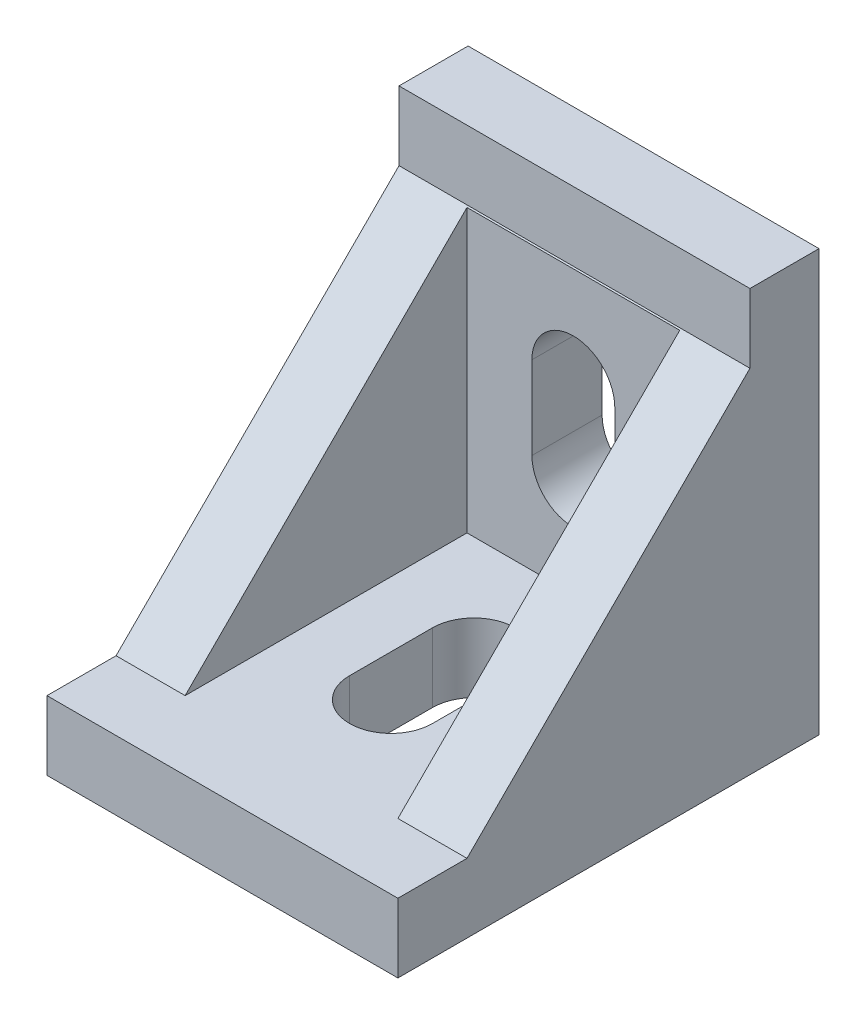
ISO-10303-21;
HEADER;
FILE_DESCRIPTION(('STEP AP214'),'2;1');
FILE_NAME('part.step','',(''),(''),'','','');
FILE_SCHEMA(('AUTOMOTIVE_DESIGN { 1 0 10303 214 1 1 1 1 }'));
ENDSEC;
DATA;
#1=APPLICATION_CONTEXT('core data for automotive mechanical design processes');
#2=APPLICATION_PROTOCOL_DEFINITION('international standard','automotive_design',2000,#1);
#3=PRODUCT_CONTEXT('',#1,'mechanical');
#4=PRODUCT('Part','Part','',(#3));
#5=PRODUCT_RELATED_PRODUCT_CATEGORY('part','',(#4));
#6=PRODUCT_DEFINITION_FORMATION('','',#4);
#7=PRODUCT_DEFINITION_CONTEXT('part definition',#1,'design');
#8=PRODUCT_DEFINITION('design','',#6,#7);
#9=PRODUCT_DEFINITION_SHAPE('','',#8);
#10=(LENGTH_UNIT() NAMED_UNIT(*) SI_UNIT(.MILLI.,.METRE.));
#11=(NAMED_UNIT(*) PLANE_ANGLE_UNIT() SI_UNIT($,.RADIAN.));
#12=(NAMED_UNIT(*) SI_UNIT($,.STERADIAN.) SOLID_ANGLE_UNIT());
#13=UNCERTAINTY_MEASURE_WITH_UNIT(LENGTH_MEASURE(1.E-05),#10,'distance_accuracy_value','');
#14=(GEOMETRIC_REPRESENTATION_CONTEXT(3) GLOBAL_UNCERTAINTY_ASSIGNED_CONTEXT((#13)) GLOBAL_UNIT_ASSIGNED_CONTEXT((#10,
#11,#12)) REPRESENTATION_CONTEXT('',''));
#15=CARTESIAN_POINT('',(0.,0.,0.));
#16=DIRECTION('',(0.,0.,1.));
#17=DIRECTION('',(1.,0.,0.));
#18=AXIS2_PLACEMENT_3D('',#15,#16,#17);
#19=CARTESIAN_POINT('',(25.4,5.,0.));
#20=DIRECTION('',(0.,0.,-1.));
#21=DIRECTION('',(0.,1.,0.));
#22=AXIS2_PLACEMENT_3D('',#19,#20,#21);
#23=PLANE('',#22);
#24=DIRECTION('',(0.,-1.,0.));
#25=VECTOR('',#24,1.);
#26=CARTESIAN_POINT('',(0.,5.,0.));
#27=LINE('',#26,#25);
#28=CARTESIAN_POINT('',(0.,5.,0.));
#29=VERTEX_POINT('',#28);
#30=CARTESIAN_POINT('',(0.,0.,0.));
#31=VERTEX_POINT('',#30);
#32=EDGE_CURVE('E261',#29,#31,#27,.T.);
#33=ORIENTED_EDGE('',*,*,#32,.T.);
#34=DIRECTION('',(-1.,0.,0.));
#35=VECTOR('',#34,1.);
#36=CARTESIAN_POINT('',(25.4,0.,0.));
#37=LINE('',#36,#35);
#38=CARTESIAN_POINT('',(25.4,0.,0.));
#39=VERTEX_POINT('',#38);
#40=EDGE_CURVE('E331',#39,#31,#37,.T.);
#41=ORIENTED_EDGE('',*,*,#40,.F.);
#42=DIRECTION('',(0.,-1.,0.));
#43=VECTOR('',#42,1.);
#44=CARTESIAN_POINT('',(25.4,5.,0.));
#45=LINE('',#44,#43);
#46=CARTESIAN_POINT('',(25.4,5.,0.));
#47=VERTEX_POINT('',#46);
#48=EDGE_CURVE('E262',#47,#39,#45,.T.);
#49=ORIENTED_EDGE('',*,*,#48,.F.);
#50=DIRECTION('',(-1.,0.,0.));
#51=VECTOR('',#50,1.);
#52=CARTESIAN_POINT('',(25.4,5.,0.));
#53=LINE('',#52,#51);
#54=EDGE_CURVE('E285',#47,#29,#53,.T.);
#55=ORIENTED_EDGE('',*,*,#54,.T.);
#56=EDGE_LOOP('',(#33,#41,#49,#55));
#57=FACE_BOUND('',#56,.T.);
#58=ADVANCED_FACE('F45',(#57),#23,.F.);
#59=CARTESIAN_POINT('',(25.4,0.,0.));
#60=DIRECTION('',(0.,1.,0.));
#61=DIRECTION('',(0.,0.,1.));
#62=AXIS2_PLACEMENT_3D('',#59,#60,#61);
#63=PLANE('',#62);
#64=DIRECTION('',(0.,0.,-1.));
#65=VECTOR('',#64,1.);
#66=CARTESIAN_POINT('',(15.7,0.,-18.2));
#67=LINE('',#66,#65);
#68=CARTESIAN_POINT('',(15.7,0.,-12.2));
#69=VERTEX_POINT('',#68);
#70=CARTESIAN_POINT('',(15.7,0.,-18.2));
#71=VERTEX_POINT('',#70);
#72=EDGE_CURVE('E178',#69,#71,#67,.T.);
#73=ORIENTED_EDGE('',*,*,#72,.T.);
#74=CARTESIAN_POINT('',(12.7,0.,-18.2));
#75=DIRECTION('',(0.,1.,0.));
#76=DIRECTION('',(0.,0.,1.));
#77=AXIS2_PLACEMENT_3D('',#74,#75,#76);
#78=CIRCLE('',#77,2.99999999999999);
#79=CARTESIAN_POINT('',(9.70000000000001,0.,-18.2));
#80=VERTEX_POINT('',#79);
#81=EDGE_CURVE('E173',#71,#80,#78,.T.);
#82=ORIENTED_EDGE('',*,*,#81,.T.);
#83=DIRECTION('',(0.,0.,1.));
#84=VECTOR('',#83,1.);
#85=CARTESIAN_POINT('',(9.70000000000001,0.,-18.2));
#86=LINE('',#85,#84);
#87=CARTESIAN_POINT('',(9.70000000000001,0.,-12.2));
#88=VERTEX_POINT('',#87);
#89=EDGE_CURVE('E181',#80,#88,#86,.T.);
#90=ORIENTED_EDGE('',*,*,#89,.T.);
#91=CARTESIAN_POINT('',(12.7,0.,-12.2));
#92=DIRECTION('',(0.,1.,0.));
#93=DIRECTION('',(0.,0.,1.));
#94=AXIS2_PLACEMENT_3D('',#91,#92,#93);
#95=CIRCLE('',#94,2.99999999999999);
#96=EDGE_CURVE('E60',#88,#69,#95,.T.);
#97=ORIENTED_EDGE('',*,*,#96,.T.);
#98=EDGE_LOOP('',(#73,#82,#90,#97));
#99=FACE_BOUND('',#98,.T.);
#100=DIRECTION('',(0.,0.,-1.));
#101=VECTOR('',#100,1.);
#102=CARTESIAN_POINT('',(0.,0.,0.));
#103=LINE('',#102,#101);
#104=CARTESIAN_POINT('',(0.,0.,-30.48));
#105=VERTEX_POINT('',#104);
#106=EDGE_CURVE('E289',#31,#105,#103,.T.);
#107=ORIENTED_EDGE('',*,*,#106,.T.);
#108=DIRECTION('',(-1.,0.,0.));
#109=VECTOR('',#108,1.);
#110=CARTESIAN_POINT('',(25.4,0.,-30.48));
#111=LINE('',#110,#109);
#112=CARTESIAN_POINT('',(25.4,0.,-30.48));
#113=VERTEX_POINT('',#112);
#114=EDGE_CURVE('E327',#113,#105,#111,.T.);
#115=ORIENTED_EDGE('',*,*,#114,.F.);
#116=DIRECTION('',(0.,0.,-1.));
#117=VECTOR('',#116,1.);
#118=CARTESIAN_POINT('',(25.4,0.,0.));
#119=LINE('',#118,#117);
#120=EDGE_CURVE('E266',#39,#113,#119,.T.);
#121=ORIENTED_EDGE('',*,*,#120,.F.);
#122=ORIENTED_EDGE('',*,*,#40,.T.);
#123=EDGE_LOOP('',(#107,#115,#121,#122));
#124=FACE_BOUND('',#123,.T.);
#125=ADVANCED_FACE('F186',(#99,#124),#63,.F.);
#126=CARTESIAN_POINT('',(25.4,0.,-30.48));
#127=DIRECTION('',(0.,0.,1.));
#128=DIRECTION('',(1.,0.,0.));
#129=AXIS2_PLACEMENT_3D('',#126,#127,#128);
#130=PLANE('',#129);
#131=DIRECTION('',(0.,1.,0.));
#132=VECTOR('',#131,1.);
#133=CARTESIAN_POINT('',(15.7,18.2,-30.48));
#134=LINE('',#133,#132);
#135=CARTESIAN_POINT('',(15.7,12.2,-30.48));
#136=VERTEX_POINT('',#135);
#137=CARTESIAN_POINT('',(15.7,18.2,-30.48));
#138=VERTEX_POINT('',#137);
#139=EDGE_CURVE('E217',#136,#138,#134,.T.);
#140=ORIENTED_EDGE('',*,*,#139,.T.);
#141=CARTESIAN_POINT('',(12.7,18.2,-30.48));
#142=DIRECTION('',(0.,0.,1.));
#143=DIRECTION('',(1.,0.,0.));
#144=AXIS2_PLACEMENT_3D('',#141,#142,#143);
#145=CIRCLE('',#144,3.);
#146=CARTESIAN_POINT('',(9.7,18.2,-30.48));
#147=VERTEX_POINT('',#146);
#148=EDGE_CURVE('E199',#138,#147,#145,.T.);
#149=ORIENTED_EDGE('',*,*,#148,.T.);
#150=DIRECTION('',(0.,-1.,0.));
#151=VECTOR('',#150,1.);
#152=CARTESIAN_POINT('',(9.7,18.2,-30.48));
#153=LINE('',#152,#151);
#154=CARTESIAN_POINT('',(9.7,12.2,-30.48));
#155=VERTEX_POINT('',#154);
#156=EDGE_CURVE('E209',#147,#155,#153,.T.);
#157=ORIENTED_EDGE('',*,*,#156,.T.);
#158=CARTESIAN_POINT('',(12.7,12.2,-30.48));
#159=DIRECTION('',(0.,0.,1.));
#160=DIRECTION('',(1.,0.,0.));
#161=AXIS2_PLACEMENT_3D('',#158,#159,#160);
#162=CIRCLE('',#161,3.);
#163=EDGE_CURVE('E213',#155,#136,#162,.T.);
#164=ORIENTED_EDGE('',*,*,#163,.T.);
#165=EDGE_LOOP('',(#140,#149,#157,#164));
#166=FACE_BOUND('',#165,.T.);
#167=DIRECTION('',(0.,1.,0.));
#168=VECTOR('',#167,1.);
#169=CARTESIAN_POINT('',(0.,0.,-30.48));
#170=LINE('',#169,#168);
#171=CARTESIAN_POINT('',(0.,30.48,-30.48));
#172=VERTEX_POINT('',#171);
#173=EDGE_CURVE('E292',#105,#172,#170,.T.);
#174=ORIENTED_EDGE('',*,*,#173,.T.);
#175=DIRECTION('',(-1.,0.,0.));
#176=VECTOR('',#175,1.);
#177=CARTESIAN_POINT('',(25.4,30.48,-30.48));
#178=LINE('',#177,#176);
#179=CARTESIAN_POINT('',(25.4,30.48,-30.48));
#180=VERTEX_POINT('',#179);
#181=EDGE_CURVE('E323',#180,#172,#178,.T.);
#182=ORIENTED_EDGE('',*,*,#181,.F.);
#183=DIRECTION('',(0.,1.,0.));
#184=VECTOR('',#183,1.);
#185=CARTESIAN_POINT('',(25.4,0.,-30.48));
#186=LINE('',#185,#184);
#187=EDGE_CURVE('E270',#113,#180,#186,.T.);
#188=ORIENTED_EDGE('',*,*,#187,.F.);
#189=ORIENTED_EDGE('',*,*,#114,.T.);
#190=EDGE_LOOP('',(#174,#182,#188,#189));
#191=FACE_BOUND('',#190,.T.);
#192=ADVANCED_FACE('F380',(#166,#191),#130,.F.);
#193=CARTESIAN_POINT('',(25.4,30.48,-30.48));
#194=DIRECTION('',(0.,-1.,0.));
#195=DIRECTION('',(0.,0.,-1.));
#196=AXIS2_PLACEMENT_3D('',#193,#194,#195);
#197=PLANE('',#196);
#198=DIRECTION('',(0.,0.,1.));
#199=VECTOR('',#198,1.);
#200=CARTESIAN_POINT('',(0.,30.48,-30.48));
#201=LINE('',#200,#199);
#202=CARTESIAN_POINT('',(0.,30.48,-25.48));
#203=VERTEX_POINT('',#202);
#204=EDGE_CURVE('E295',#172,#203,#201,.T.);
#205=ORIENTED_EDGE('',*,*,#204,.T.);
#206=DIRECTION('',(-1.,0.,0.));
#207=VECTOR('',#206,1.);
#208=CARTESIAN_POINT('',(25.4,30.48,-25.48));
#209=LINE('',#208,#207);
#210=CARTESIAN_POINT('',(25.4,30.48,-25.48));
#211=VERTEX_POINT('',#210);
#212=EDGE_CURVE('E319',#211,#203,#209,.T.);
#213=ORIENTED_EDGE('',*,*,#212,.F.);
#214=DIRECTION('',(0.,0.,1.));
#215=VECTOR('',#214,1.);
#216=CARTESIAN_POINT('',(25.4,30.48,-30.48));
#217=LINE('',#216,#215);
#218=EDGE_CURVE('E273',#180,#211,#217,.T.);
#219=ORIENTED_EDGE('',*,*,#218,.F.);
#220=ORIENTED_EDGE('',*,*,#181,.T.);
#221=EDGE_LOOP('',(#205,#213,#219,#220));
#222=FACE_BOUND('',#221,.T.);
#223=ADVANCED_FACE('F412',(#222),#197,.F.);
#224=CARTESIAN_POINT('',(25.4,30.48,-25.48));
#225=DIRECTION('',(0.,0.,-1.));
#226=DIRECTION('',(-1.,0.,0.));
#227=AXIS2_PLACEMENT_3D('',#224,#225,#226);
#228=PLANE('',#227);
#229=DIRECTION('',(0.,-1.,0.));
#230=VECTOR('',#229,1.);
#231=CARTESIAN_POINT('',(0.,30.48,-25.48));
#232=LINE('',#231,#230);
#233=CARTESIAN_POINT('',(0.,25.48,-25.48));
#234=VERTEX_POINT('',#233);
#235=EDGE_CURVE('E298',#203,#234,#232,.T.);
#236=ORIENTED_EDGE('',*,*,#235,.T.);
#237=DIRECTION('',(-1.,0.,0.));
#238=VECTOR('',#237,1.);
#239=CARTESIAN_POINT('',(25.4,25.48,-25.48));
#240=LINE('',#239,#238);
#241=CARTESIAN_POINT('',(25.4,25.48,-25.48));
#242=VERTEX_POINT('',#241);
#243=EDGE_CURVE('E315',#242,#234,#240,.T.);
#244=ORIENTED_EDGE('',*,*,#243,.F.);
#245=DIRECTION('',(0.,-1.,0.));
#246=VECTOR('',#245,1.);
#247=CARTESIAN_POINT('',(25.4,30.48,-25.48));
#248=LINE('',#247,#246);
#249=EDGE_CURVE('E276',#211,#242,#248,.T.);
#250=ORIENTED_EDGE('',*,*,#249,.F.);
#251=ORIENTED_EDGE('',*,*,#212,.T.);
#252=EDGE_LOOP('',(#236,#244,#250,#251));
#253=FACE_BOUND('',#252,.T.);
#254=ADVANCED_FACE('F407',(#253),#228,.F.);
#255=CARTESIAN_POINT('',(25.4,25.48,-25.48));
#256=DIRECTION('',(0.,-0.707106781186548,-0.707106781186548));
#257=DIRECTION('',(0.,0.707106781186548,-0.707106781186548));
#258=AXIS2_PLACEMENT_3D('',#255,#256,#257);
#259=PLANE('',#258);
#260=DIRECTION('',(-1.,0.,0.));
#261=VECTOR('',#260,1.);
#262=CARTESIAN_POINT('',(25.4,5.,-5.));
#263=LINE('',#262,#261);
#264=CARTESIAN_POINT('',(5.,5.,-5.));
#265=VERTEX_POINT('',#264);
#266=CARTESIAN_POINT('',(0.,5.,-5.));
#267=VERTEX_POINT('',#266);
#268=EDGE_CURVE('E310',#265,#267,#263,.T.);
#269=ORIENTED_EDGE('',*,*,#268,.F.);
#270=DIRECTION('',(0.,0.707106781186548,-0.707106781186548));
#271=VECTOR('',#270,1.);
#272=CARTESIAN_POINT('',(5.,25.48,-25.48));
#273=LINE('',#272,#271);
#274=CARTESIAN_POINT('',(5.,25.4,-25.4));
#275=VERTEX_POINT('',#274);
#276=EDGE_CURVE('E257',#265,#275,#273,.T.);
#277=ORIENTED_EDGE('',*,*,#276,.T.);
#278=DIRECTION('',(-1.,0.,0.));
#279=VECTOR('',#278,1.);
#280=CARTESIAN_POINT('',(25.4,25.4,-25.4));
#281=LINE('',#280,#279);
#282=CARTESIAN_POINT('',(20.4,25.4,-25.4));
#283=VERTEX_POINT('',#282);
#284=EDGE_CURVE('E335',#283,#275,#281,.T.);
#285=ORIENTED_EDGE('',*,*,#284,.F.);
#286=DIRECTION('',(0.,-0.707106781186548,0.707106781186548));
#287=VECTOR('',#286,1.);
#288=CARTESIAN_POINT('',(20.4,25.48,-25.48));
#289=LINE('',#288,#287);
#290=CARTESIAN_POINT('',(20.4,5.,-5.));
#291=VERTEX_POINT('',#290);
#292=EDGE_CURVE('E250',#283,#291,#289,.T.);
#293=ORIENTED_EDGE('',*,*,#292,.T.);
#294=CARTESIAN_POINT('',(25.4,5.,-5.));
#295=VERTEX_POINT('',#294);
#296=EDGE_CURVE('E311',#295,#291,#263,.T.);
#297=ORIENTED_EDGE('',*,*,#296,.F.);
#298=DIRECTION('',(0.,-0.707106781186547,0.707106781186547));
#299=VECTOR('',#298,1.);
#300=CARTESIAN_POINT('',(25.4,25.48,-25.48));
#301=LINE('',#300,#299);
#302=EDGE_CURVE('E279',#242,#295,#301,.T.);
#303=ORIENTED_EDGE('',*,*,#302,.F.);
#304=ORIENTED_EDGE('',*,*,#243,.T.);
#305=DIRECTION('',(0.,-0.707106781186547,0.707106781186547));
#306=VECTOR('',#305,1.);
#307=CARTESIAN_POINT('',(0.,25.48,-25.48));
#308=LINE('',#307,#306);
#309=EDGE_CURVE('E301',#234,#267,#308,.T.);
#310=ORIENTED_EDGE('',*,*,#309,.T.);
#311=EDGE_LOOP('',(#269,#277,#285,#293,#297,#303,#304,#310));
#312=FACE_BOUND('',#311,.T.);
#313=ADVANCED_FACE('F403',(#312),#259,.F.);
#314=CARTESIAN_POINT('',(25.4,5.,-5.));
#315=DIRECTION('',(0.,-1.,0.));
#316=DIRECTION('',(0.,0.,-1.));
#317=AXIS2_PLACEMENT_3D('',#314,#315,#316);
#318=PLANE('',#317);
#319=DIRECTION('',(0.,0.,-1.));
#320=VECTOR('',#319,1.);
#321=CARTESIAN_POINT('',(9.70000000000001,5.,-5.));
#322=LINE('',#321,#320);
#323=CARTESIAN_POINT('',(9.70000000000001,5.,-12.2));
#324=VERTEX_POINT('',#323);
#325=CARTESIAN_POINT('',(9.70000000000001,5.,-18.2));
#326=VERTEX_POINT('',#325);
#327=EDGE_CURVE('E351',#324,#326,#322,.T.);
#328=ORIENTED_EDGE('',*,*,#327,.T.);
#329=CARTESIAN_POINT('',(12.7,5.,-18.2));
#330=DIRECTION('',(0.,-1.,0.));
#331=DIRECTION('',(0.,0.,-1.));
#332=AXIS2_PLACEMENT_3D('',#329,#330,#331);
#333=CIRCLE('',#332,2.99999999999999);
#334=CARTESIAN_POINT('',(15.7,5.,-18.2));
#335=VERTEX_POINT('',#334);
#336=EDGE_CURVE('E11',#326,#335,#333,.T.);
#337=ORIENTED_EDGE('',*,*,#336,.T.);
#338=DIRECTION('',(0.,0.,1.));
#339=VECTOR('',#338,1.);
#340=CARTESIAN_POINT('',(15.7,5.,-5.));
#341=LINE('',#340,#339);
#342=CARTESIAN_POINT('',(15.7,5.,-12.2));
#343=VERTEX_POINT('',#342);
#344=EDGE_CURVE('E53',#335,#343,#341,.T.);
#345=ORIENTED_EDGE('',*,*,#344,.T.);
#346=CARTESIAN_POINT('',(12.7,5.,-12.2));
#347=DIRECTION('',(0.,-1.,0.));
#348=DIRECTION('',(0.,0.,-1.));
#349=AXIS2_PLACEMENT_3D('',#346,#347,#348);
#350=CIRCLE('',#349,2.99999999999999);
#351=EDGE_CURVE('E354',#343,#324,#350,.T.);
#352=ORIENTED_EDGE('',*,*,#351,.T.);
#353=EDGE_LOOP('',(#328,#337,#345,#352));
#354=FACE_BOUND('',#353,.T.);
#355=ORIENTED_EDGE('',*,*,#296,.T.);
#356=DIRECTION('',(0.,0.,1.));
#357=VECTOR('',#356,1.);
#358=CARTESIAN_POINT('',(20.4,5.,-25.4));
#359=LINE('',#358,#357);
#360=CARTESIAN_POINT('',(20.4,5.,-25.4));
#361=VERTEX_POINT('',#360);
#362=EDGE_CURVE('E247',#361,#291,#359,.T.);
#363=ORIENTED_EDGE('',*,*,#362,.F.);
#364=DIRECTION('',(1.,0.,0.));
#365=VECTOR('',#364,1.);
#366=CARTESIAN_POINT('',(5.,5.,-25.4));
#367=LINE('',#366,#365);
#368=CARTESIAN_POINT('',(5.,5.,-25.4));
#369=VERTEX_POINT('',#368);
#370=EDGE_CURVE('E239',#369,#361,#367,.T.);
#371=ORIENTED_EDGE('',*,*,#370,.F.);
#372=DIRECTION('',(0.,0.,1.));
#373=VECTOR('',#372,1.);
#374=CARTESIAN_POINT('',(5.,5.,-25.4));
#375=LINE('',#374,#373);
#376=EDGE_CURVE('E246',#369,#265,#375,.T.);
#377=ORIENTED_EDGE('',*,*,#376,.T.);
#378=ORIENTED_EDGE('',*,*,#268,.T.);
#379=DIRECTION('',(0.,0.,1.));
#380=VECTOR('',#379,1.);
#381=CARTESIAN_POINT('',(0.,5.,-5.));
#382=LINE('',#381,#380);
#383=EDGE_CURVE('E267',#267,#29,#382,.T.);
#384=ORIENTED_EDGE('',*,*,#383,.T.);
#385=ORIENTED_EDGE('',*,*,#54,.F.);
#386=DIRECTION('',(0.,0.,1.));
#387=VECTOR('',#386,1.);
#388=CARTESIAN_POINT('',(25.4,5.,-5.));
#389=LINE('',#388,#387);
#390=EDGE_CURVE('E282',#295,#47,#389,.T.);
#391=ORIENTED_EDGE('',*,*,#390,.F.);
#392=EDGE_LOOP('',(#355,#363,#371,#377,#378,#384,#385,#391));
#393=FACE_BOUND('',#392,.T.);
#394=ADVANCED_FACE('F360',(#354,#393),#318,.F.);
#395=CARTESIAN_POINT('',(25.4,0.,0.));
#396=DIRECTION('',(1.,0.,0.));
#397=DIRECTION('',(0.,0.,-1.));
#398=AXIS2_PLACEMENT_3D('',#395,#396,#397);
#399=PLANE('',#398);
#400=ORIENTED_EDGE('',*,*,#48,.T.);
#401=ORIENTED_EDGE('',*,*,#120,.T.);
#402=ORIENTED_EDGE('',*,*,#187,.T.);
#403=ORIENTED_EDGE('',*,*,#218,.T.);
#404=ORIENTED_EDGE('',*,*,#249,.T.);
#405=ORIENTED_EDGE('',*,*,#302,.T.);
#406=ORIENTED_EDGE('',*,*,#390,.T.);
#407=EDGE_LOOP('',(#400,#401,#402,#403,#404,#405,#406));
#408=FACE_BOUND('',#407,.T.);
#409=ADVANCED_FACE('F394',(#408),#399,.T.);
#410=CARTESIAN_POINT('',(0.,0.,0.));
#411=DIRECTION('',(1.,0.,0.));
#412=DIRECTION('',(0.,0.,-1.));
#413=AXIS2_PLACEMENT_3D('',#410,#411,#412);
#414=PLANE('',#413);
#415=ORIENTED_EDGE('',*,*,#32,.F.);
#416=ORIENTED_EDGE('',*,*,#383,.F.);
#417=ORIENTED_EDGE('',*,*,#309,.F.);
#418=ORIENTED_EDGE('',*,*,#235,.F.);
#419=ORIENTED_EDGE('',*,*,#204,.F.);
#420=ORIENTED_EDGE('',*,*,#173,.F.);
#421=ORIENTED_EDGE('',*,*,#106,.F.);
#422=EDGE_LOOP('',(#415,#416,#417,#418,#419,#420,#421));
#423=FACE_BOUND('',#422,.T.);
#424=ADVANCED_FACE('F387',(#423),#414,.F.);
#425=CARTESIAN_POINT('',(0.,0.,-25.4));
#426=DIRECTION('',(0.,0.,1.));
#427=DIRECTION('',(1.,0.,0.));
#428=AXIS2_PLACEMENT_3D('',#425,#426,#427);
#429=PLANE('',#428);
#430=CARTESIAN_POINT('',(12.7,18.2,-25.4));
#431=DIRECTION('',(0.,0.,1.));
#432=DIRECTION('',(1.,0.,0.));
#433=AXIS2_PLACEMENT_3D('',#430,#431,#432);
#434=CIRCLE('',#433,3.);
#435=CARTESIAN_POINT('',(15.7,18.2,-25.4));
#436=VERTEX_POINT('',#435);
#437=CARTESIAN_POINT('',(9.7,18.2,-25.4));
#438=VERTEX_POINT('',#437);
#439=EDGE_CURVE('E347',#436,#438,#434,.T.);
#440=ORIENTED_EDGE('',*,*,#439,.F.);
#441=DIRECTION('',(0.,1.,0.));
#442=VECTOR('',#441,1.);
#443=CARTESIAN_POINT('',(15.7,0.,-25.4));
#444=LINE('',#443,#442);
#445=CARTESIAN_POINT('',(15.7,12.2,-25.4));
#446=VERTEX_POINT('',#445);
#447=EDGE_CURVE('E344',#446,#436,#444,.T.);
#448=ORIENTED_EDGE('',*,*,#447,.F.);
#449=CARTESIAN_POINT('',(12.7,12.2,-25.4));
#450=DIRECTION('',(0.,0.,1.));
#451=DIRECTION('',(1.,0.,0.));
#452=AXIS2_PLACEMENT_3D('',#449,#450,#451);
#453=CIRCLE('',#452,3.);
#454=CARTESIAN_POINT('',(9.7,12.2,-25.4));
#455=VERTEX_POINT('',#454);
#456=EDGE_CURVE('E341',#455,#446,#453,.T.);
#457=ORIENTED_EDGE('',*,*,#456,.F.);
#458=DIRECTION('',(0.,-1.,0.));
#459=VECTOR('',#458,1.);
#460=CARTESIAN_POINT('',(9.70000000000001,0.,-25.4));
#461=LINE('',#460,#459);
#462=EDGE_CURVE('E338',#438,#455,#461,.T.);
#463=ORIENTED_EDGE('',*,*,#462,.F.);
#464=EDGE_LOOP('',(#440,#448,#457,#463));
#465=FACE_BOUND('',#464,.T.);
#466=ORIENTED_EDGE('',*,*,#284,.T.);
#467=DIRECTION('',(0.,-1.,0.));
#468=VECTOR('',#467,1.);
#469=CARTESIAN_POINT('',(5.,25.48,-25.4));
#470=LINE('',#469,#468);
#471=EDGE_CURVE('E226',#275,#369,#470,.T.);
#472=ORIENTED_EDGE('',*,*,#471,.T.);
#473=ORIENTED_EDGE('',*,*,#370,.T.);
#474=DIRECTION('',(0.,1.,0.));
#475=VECTOR('',#474,1.);
#476=CARTESIAN_POINT('',(20.4,25.48,-25.4));
#477=LINE('',#476,#475);
#478=EDGE_CURVE('E243',#361,#283,#477,.T.);
#479=ORIENTED_EDGE('',*,*,#478,.T.);
#480=EDGE_LOOP('',(#466,#472,#473,#479));
#481=FACE_BOUND('',#480,.T.);
#482=ADVANCED_FACE('F431',(#465,#481),#429,.T.);
#483=CARTESIAN_POINT('',(5.,25.48,-25.4));
#484=DIRECTION('',(-1.,0.,0.));
#485=DIRECTION('',(0.,-1.,0.));
#486=AXIS2_PLACEMENT_3D('',#483,#484,#485);
#487=PLANE('',#486);
#488=ORIENTED_EDGE('',*,*,#376,.F.);
#489=ORIENTED_EDGE('',*,*,#471,.F.);
#490=ORIENTED_EDGE('',*,*,#276,.F.);
#491=EDGE_LOOP('',(#488,#489,#490));
#492=FACE_BOUND('',#491,.T.);
#493=ADVANCED_FACE('F434',(#492),#487,.F.);
#494=CARTESIAN_POINT('',(20.4,25.48,-25.4));
#495=DIRECTION('',(1.,0.,0.));
#496=DIRECTION('',(0.,1.,0.));
#497=AXIS2_PLACEMENT_3D('',#494,#495,#496);
#498=PLANE('',#497);
#499=ORIENTED_EDGE('',*,*,#478,.F.);
#500=ORIENTED_EDGE('',*,*,#362,.T.);
#501=ORIENTED_EDGE('',*,*,#292,.F.);
#502=EDGE_LOOP('',(#499,#500,#501));
#503=FACE_BOUND('',#502,.T.);
#504=ADVANCED_FACE('F437',(#503),#498,.F.);
#505=CARTESIAN_POINT('',(12.7,18.2,-30.48));
#506=DIRECTION('',(0.,0.,1.));
#507=DIRECTION('',(1.,0.,0.));
#508=AXIS2_PLACEMENT_3D('',#505,#506,#507);
#509=CYLINDRICAL_SURFACE('',#508,3.);
#510=ORIENTED_EDGE('',*,*,#439,.T.);
#511=DIRECTION('',(0.,0.,1.));
#512=VECTOR('',#511,1.);
#513=CARTESIAN_POINT('',(9.7,18.2,-30.48));
#514=LINE('',#513,#512);
#515=EDGE_CURVE('E221',#147,#438,#514,.T.);
#516=ORIENTED_EDGE('',*,*,#515,.F.);
#517=ORIENTED_EDGE('',*,*,#148,.F.);
#518=DIRECTION('',(0.,0.,1.));
#519=VECTOR('',#518,1.);
#520=CARTESIAN_POINT('',(15.7,18.2,-30.48));
#521=LINE('',#520,#519);
#522=EDGE_CURVE('E222',#138,#436,#521,.T.);
#523=ORIENTED_EDGE('',*,*,#522,.T.);
#524=EDGE_LOOP('',(#510,#516,#517,#523));
#525=FACE_BOUND('',#524,.T.);
#526=ADVANCED_FACE('F440',(#525),#509,.F.);
#527=CARTESIAN_POINT('',(15.7,18.2,-30.48));
#528=DIRECTION('',(1.,0.,0.));
#529=DIRECTION('',(0.,1.,0.));
#530=AXIS2_PLACEMENT_3D('',#527,#528,#529);
#531=PLANE('',#530);
#532=ORIENTED_EDGE('',*,*,#447,.T.);
#533=ORIENTED_EDGE('',*,*,#522,.F.);
#534=ORIENTED_EDGE('',*,*,#139,.F.);
#535=DIRECTION('',(0.,0.,1.));
#536=VECTOR('',#535,1.);
#537=CARTESIAN_POINT('',(15.7,12.2,-30.48));
#538=LINE('',#537,#536);
#539=EDGE_CURVE('E227',#136,#446,#538,.T.);
#540=ORIENTED_EDGE('',*,*,#539,.T.);
#541=EDGE_LOOP('',(#532,#533,#534,#540));
#542=FACE_BOUND('',#541,.T.);
#543=ADVANCED_FACE('F446',(#542),#531,.F.);
#544=CARTESIAN_POINT('',(12.7,12.2,-30.48));
#545=DIRECTION('',(0.,0.,1.));
#546=DIRECTION('',(1.,0.,0.));
#547=AXIS2_PLACEMENT_3D('',#544,#545,#546);
#548=CYLINDRICAL_SURFACE('',#547,3.);
#549=ORIENTED_EDGE('',*,*,#456,.T.);
#550=ORIENTED_EDGE('',*,*,#539,.F.);
#551=ORIENTED_EDGE('',*,*,#163,.F.);
#552=DIRECTION('',(0.,0.,1.));
#553=VECTOR('',#552,1.);
#554=CARTESIAN_POINT('',(9.7,12.2,-30.48));
#555=LINE('',#554,#553);
#556=EDGE_CURVE('E231',#155,#455,#555,.T.);
#557=ORIENTED_EDGE('',*,*,#556,.T.);
#558=EDGE_LOOP('',(#549,#550,#551,#557));
#559=FACE_BOUND('',#558,.T.);
#560=ADVANCED_FACE('F451',(#559),#548,.F.);
#561=CARTESIAN_POINT('',(9.7,18.2,-30.48));
#562=DIRECTION('',(-1.,0.,0.));
#563=DIRECTION('',(0.,-1.,0.));
#564=AXIS2_PLACEMENT_3D('',#561,#562,#563);
#565=PLANE('',#564);
#566=ORIENTED_EDGE('',*,*,#462,.T.);
#567=ORIENTED_EDGE('',*,*,#556,.F.);
#568=ORIENTED_EDGE('',*,*,#156,.F.);
#569=ORIENTED_EDGE('',*,*,#515,.T.);
#570=EDGE_LOOP('',(#566,#567,#568,#569));
#571=FACE_BOUND('',#570,.T.);
#572=ADVANCED_FACE('F448',(#571),#565,.F.);
#573=CARTESIAN_POINT('',(12.7,0.,-18.2));
#574=DIRECTION('',(0.,1.,0.));
#575=DIRECTION('',(0.,0.,1.));
#576=AXIS2_PLACEMENT_3D('',#573,#574,#575);
#577=CYLINDRICAL_SURFACE('',#576,2.99999999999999);
#578=DIRECTION('',(0.,1.,0.));
#579=VECTOR('',#578,1.);
#580=CARTESIAN_POINT('',(9.70000000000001,0.,-18.2));
#581=LINE('',#580,#579);
#582=EDGE_CURVE('E68',#80,#326,#581,.T.);
#583=ORIENTED_EDGE('',*,*,#582,.F.);
#584=ORIENTED_EDGE('',*,*,#81,.F.);
#585=DIRECTION('',(0.,1.,0.));
#586=VECTOR('',#585,1.);
#587=CARTESIAN_POINT('',(15.7,0.,-18.2));
#588=LINE('',#587,#586);
#589=EDGE_CURVE('E196',#71,#335,#588,.T.);
#590=ORIENTED_EDGE('',*,*,#589,.T.);
#591=ORIENTED_EDGE('',*,*,#336,.F.);
#592=EDGE_LOOP('',(#583,#584,#590,#591));
#593=FACE_BOUND('',#592,.T.);
#594=ADVANCED_FACE('F170',(#593),#577,.F.);
#595=CARTESIAN_POINT('',(15.7,0.,-18.2));
#596=DIRECTION('',(1.,0.,0.));
#597=DIRECTION('',(0.,0.,-1.));
#598=AXIS2_PLACEMENT_3D('',#595,#596,#597);
#599=PLANE('',#598);
#600=ORIENTED_EDGE('',*,*,#589,.F.);
#601=ORIENTED_EDGE('',*,*,#72,.F.);
#602=DIRECTION('',(0.,1.,0.));
#603=VECTOR('',#602,1.);
#604=CARTESIAN_POINT('',(15.7,0.,-12.2));
#605=LINE('',#604,#603);
#606=EDGE_CURVE('E200',#69,#343,#605,.T.);
#607=ORIENTED_EDGE('',*,*,#606,.T.);
#608=ORIENTED_EDGE('',*,*,#344,.F.);
#609=EDGE_LOOP('',(#600,#601,#607,#608));
#610=FACE_BOUND('',#609,.T.);
#611=ADVANCED_FACE('F363',(#610),#599,.F.);
#612=CARTESIAN_POINT('',(12.7,0.,-12.2));
#613=DIRECTION('',(0.,1.,0.));
#614=DIRECTION('',(0.,0.,1.));
#615=AXIS2_PLACEMENT_3D('',#612,#613,#614);
#616=CYLINDRICAL_SURFACE('',#615,2.99999999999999);
#617=ORIENTED_EDGE('',*,*,#606,.F.);
#618=ORIENTED_EDGE('',*,*,#96,.F.);
#619=DIRECTION('',(0.,1.,0.));
#620=VECTOR('',#619,1.);
#621=CARTESIAN_POINT('',(9.70000000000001,0.,-12.2));
#622=LINE('',#621,#620);
#623=EDGE_CURVE('E177',#88,#324,#622,.T.);
#624=ORIENTED_EDGE('',*,*,#623,.T.);
#625=ORIENTED_EDGE('',*,*,#351,.F.);
#626=EDGE_LOOP('',(#617,#618,#624,#625));
#627=FACE_BOUND('',#626,.T.);
#628=ADVANCED_FACE('F364',(#627),#616,.F.);
#629=CARTESIAN_POINT('',(9.70000000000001,0.,-18.2));
#630=DIRECTION('',(-1.,0.,0.));
#631=DIRECTION('',(0.,0.,1.));
#632=AXIS2_PLACEMENT_3D('',#629,#630,#631);
#633=PLANE('',#632);
#634=ORIENTED_EDGE('',*,*,#623,.F.);
#635=ORIENTED_EDGE('',*,*,#89,.F.);
#636=ORIENTED_EDGE('',*,*,#582,.T.);
#637=ORIENTED_EDGE('',*,*,#327,.F.);
#638=EDGE_LOOP('',(#634,#635,#636,#637));
#639=FACE_BOUND('',#638,.T.);
#640=ADVANCED_FACE('F182',(#639),#633,.F.);
#641=CLOSED_SHELL('',(#58,#125,#192,#223,#254,#313,#394,#409,#424,#482,#493,#504,#526,#543,#560,
#572,#594,#611,#628,#640));
#642=MANIFOLD_SOLID_BREP('B2',#641);
#643=ADVANCED_BREP_SHAPE_REPRESENTATION('',(#18,#642),#14);
#644=SHAPE_DEFINITION_REPRESENTATION(#9,#643);
ENDSEC;
END-ISO-10303-21;
